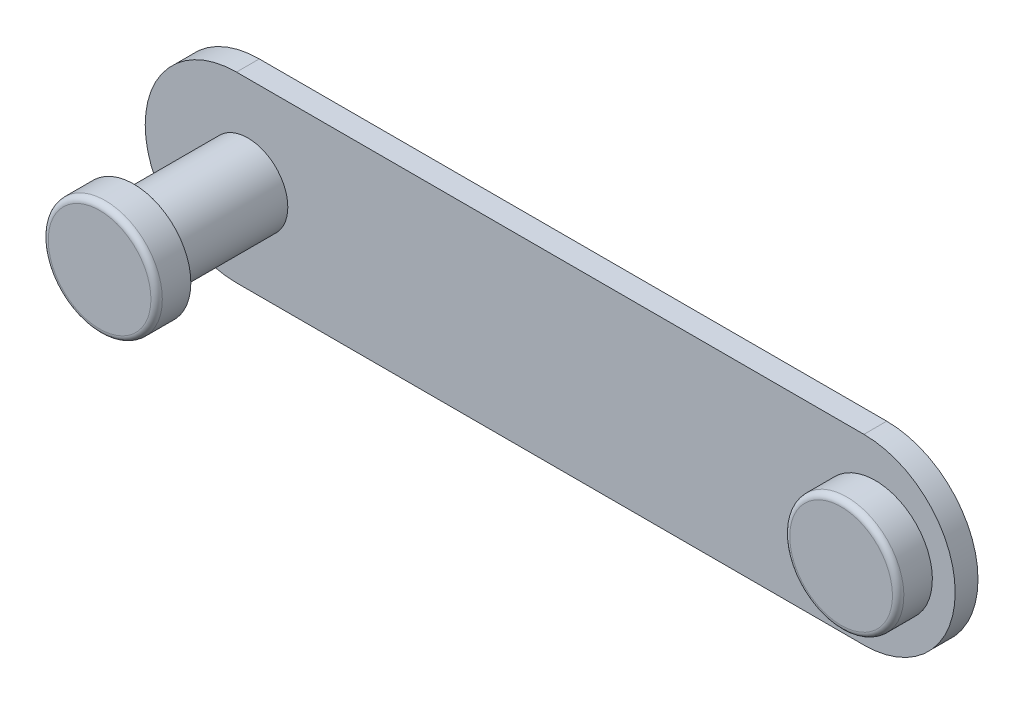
from build123d import *

# Parameters (mm, degrees)
EXTRUDE_1_DEPTH = 2


with BuildPart() as part:
    # Sketch 1 → Extrude 1 (new body)
    with BuildSketch(Plane.XY):
        with BuildLine():
            Line((-56, -8), (-1, -8))
            ThreePointArc((-1, -8), (7, 0), (-1, 8))
            Line((-1, 8), (-56, 8))
            ThreePointArc((-56, 8), (-64, 0), (-56, -8))
        make_face()
    extrude(amount=EXTRUDE_1_DEPTH)

    # Sketch 2 → Revolve 1 (revolve)
    with BuildSketch(Plane(origin=(0, 0, 0), x_dir=(0, 0, -1), z_dir=(1, 0, 0)), mode=Mode.PRIVATE) as revolve_1_sk:
        with BuildLine():
            Line((-5, 0), (-5, 4.5))
            ThreePointArc((-5, 4.5), (-4.853553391, 4.853553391), (-4.5, 5))
            Line((-4.5, 5), (-2, 5))
            Line((-2, 5), (-2, 3.6))
            Line((-2, 3.6), (0, 3.6))
            Line((0, 3.6), (0, 0))
            Line((0, 0), (-5, 0))
        make_face()
    revolve(revolve_1_sk.sketch.rotate(Axis((0, 0, 2), (0, 0, 1)), 180), axis=Axis((0, 0, 2), (0, 0, 1)))

    # Sketch 3 → Revolve 2 (revolve)
    with BuildSketch(Plane(origin=(0, 0, 0), x_dir=(-1, 0, 0), z_dir=(0, 1, 0)), mode=Mode.PRIVATE) as revolve_2_sk:
        with BuildLine():
            Line((55, 15), (59.5, 15))
            ThreePointArc((59.5, 15), (59.853553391, 14.853553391), (60, 14.5))
            Line((60, 14.5), (60, 12))
            Line((60, 12), (58.5, 12))
            Line((58.5, 12), (58.5, 2))
            Line((58.5, 2), (55, 2))
            Line((55, 2), (55, 15))
        make_face()
    revolve(revolve_2_sk.sketch.rotate(Axis((-55, 0, 2), (0, 0, 1)), 180), axis=Axis((-55, 0, 2), (0, 0, 1)))


solid = part.part
